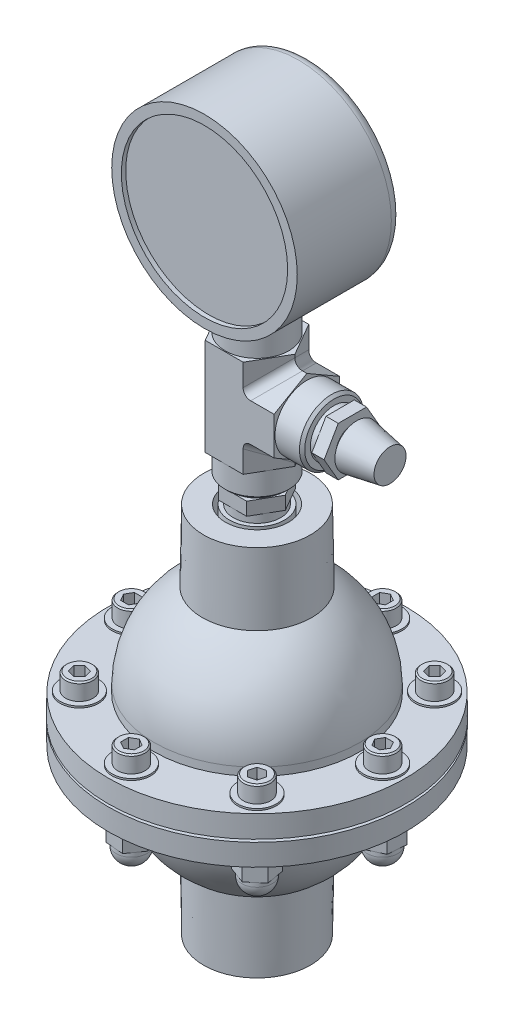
from build123d import *

# Parameters (mm, degrees)
SKETCH1_R                    = 43.2435
EXTRUDE1_DEPTH               = 6.35
EXTRUDE1_TAPER               = 1
SKETCH2_R                    = 29.972
EXTRUDE2_DEPTH               = 37.338
EXTRUDE2_TAPER               = 1
FILLET1_R                    = 29.21
SKETCH3_R                    = 15.494
EXTRUDE3_DEPTH               = 53.6702
EXTRUDE3_DRAFT               = 1
SKETCH4_R                    = 9.144
SKETCH4_R_2                  = 8.001
EXTRUDE4_DEPTH               = 16.637
EXTRUDE4_DRAFT               = -1
SKETCH7_R                    = 43.2435
EXTRUDE5_DEPTH               = 6.35
EXTRUDE5_DRAFT               = -1
SKETCH8_R                    = 32.4866
EXTRUDE6_DEPTH               = 6.35
SKETCH9_R                    = 29.972
EXTRUDE7_DEPTH               = 37.338
EXTRUDE7_DRAFT               = -1
FILLET2_R                    = 29.21
SKETCH11_R                   = 15.494
EXTRUDE8_DEPTH               = 60.833
EXTRUDE8_DRAFT               = -1
SKETCH14_R                   = 5.5626
EXTRUDE9_DEPTH               = 0.508
EXTRUDE10_START              = -0.508
SKETCH15_R                   = 5.5626
EXTRUDE10_DEPTH              = 0.508
SKETCH16_R                   = 3.9624
EXTRUDE11_DEPTH              = 5.334
EXTRUDE12_DEPTH              = 3.175
CHAMFER1_SIZE                = 0.381
EXTRUDE13_DEPTH              = 5.334
SKETCH19_R                   = 4.445
EXTRUDE14_DEPTH              = 10.922
FILLET3_R                    = 4.318
CIRPATTERN1_COUNT            = 8
CHAMFER1_OF_CIRPATTERN1_SIZE = 0.381
FILLET3_OF_CIRPATTERN1_R     = 4.318
SKETCH20_R                   = 6.858
BOSS_EXTRUDE1_DEPTH          = 132.334
SKETCH21_R                   = 26.924
BOSS_EXTRUDE2_DEPTH          = 15.24
BOSS_EXTRUDE3_DEPTH          = 3.81
SKETCH24_R                   = 9.271
BOSS_EXTRUDE4_DEPTH          = 43.18
BOSS_EXTRUDE5_DEPTH          = 28.194
SKETCH26_R                   = 9.271
BOSS_EXTRUDE6_DEPTH          = 22.098
BOSS_EXTRUDE7_DEPTH          = 14.224
SKETCH28_R                   = 6.858
BOSS_EXTRUDE8_DEPTH          = 14.224
BOSS_EXTRUDE9_DEPTH          = 3.556
SKETCH30_R                   = 4.7625
BOSS_EXTRUDE10_DEPTH         = 3.556
SKETCH31_R                   = 6.35
BOSS_EXTRUDE11_DEPTH         = 9.652
BOSS_EXTRUDE11_TAPER         = 10
FILLET4_R                    = 2.54
CHAMFER2_SIZE                = 0.762
FILLET5_R                    = 3.175
SKETCH32_R                   = 24.13
CUT_EXTRUDE1_DEPTH           = 1.27


with BuildPart() as part:
    # Sketch1 → Extrude1 (new body)
    with BuildSketch(Plane(origin=(0, 0, 0), x_dir=(1, 0, 0), z_dir=(0, 1, 0))):
        Circle(SKETCH1_R)
    extrude(amount=EXTRUDE1_DEPTH, taper=EXTRUDE1_TAPER)

    # Sketch2 → Extrude2 (add)
    with BuildSketch(Plane(origin=(0, 0, 0), x_dir=(1, 0, 0), z_dir=(0, 1, 0))):
        Circle(SKETCH2_R)
    extrude(amount=EXTRUDE2_DEPTH, taper=EXTRUDE2_TAPER)

    # Fillet1
    fillet1_edges = [part.edges().sort_by_distance(p)[0] for p in [
        (-29.320262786, 37.338, 0),
    ]]
    fillet(fillet1_edges, radius=FILLET1_R)


with BuildPart() as extrude3_tool:
    # Sketch3 → Extrude3 (with draft: the straight prism first)
    with BuildSketch(Plane(origin=(0, 53.6702, 0), x_dir=(-1, 0, 0), z_dir=(0, 1, 0))):
        Circle(SKETCH3_R)
    extrude(amount=-EXTRUDE3_DEPTH)
    # Extrude3: the draft: its side faces are tilted about the plane it starts from
    extrude3_sides = [extrude3_tool.faces().sort_by_distance(p)[0] for p in [
        (15.494, 26.8351, 0),
    ]]
    draft(extrude3_sides, Plane(origin=(0, 53.6702, 0), x_dir=(-1, 0, 0), z_dir=(0, 1, 0)), EXTRUDE3_DRAFT)


with BuildPart() as part_1:
    add(part.part)

    # Extrude3: add extrude3_tool
    add(extrude3_tool.part)


with BuildPart() as extrude4_tool:
    # Sketch4 → Extrude4 (with draft: the straight prism first)
    with BuildSketch(Plane(origin=(0, 53.6702, 0), x_dir=(-1, 0, 0), z_dir=(0, 1, 0))):
        Circle(SKETCH4_R)
        Circle(SKETCH4_R_2, mode=Mode.SUBTRACT)
    extrude(amount=-EXTRUDE4_DEPTH)
    # Extrude4: the draft: its side faces are tilted about the plane it starts from
    extrude4_sides = [extrude4_tool.faces().sort_by_distance(p)[0] for p in [
        (9.144, 45.3517, 0),
        (8.001, 45.3517, 0),
    ]]
    draft(extrude4_sides, Plane(origin=(0, 53.6702, 0), x_dir=(-1, 0, 0), z_dir=(0, 1, 0)), EXTRUDE4_DRAFT)


with BuildPart() as part_2:
    add(part_1.part)

    # Extrude4: cut by extrude4_tool
    add(extrude4_tool.part, mode=Mode.SUBTRACT)

    # Sketch5 → 1_4 NPT Tapped Hole1 (revolve, cut)
    with BuildSketch(Plane(origin=(0, 53.6702, 0), x_dir=(0, 0, 1), z_dir=(1, 0, 0))):
        Polygon((0, 0), (0, 20.360347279), (5.5626, 17.018), (5.5626, 9.906), (6.557984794, 9.906), (6.8545837, 0), align=None)
    revolve(axis=Axis((0, 60.0202, 0), (0, -1, 0)), mode=Mode.SUBTRACT)



with BuildPart() as body_2:
    # Sketch7 → Extrude5 (with draft: the straight prism first)
    with BuildSketch(Plane(origin=(0, -0.762, 0), x_dir=(-1, 0, 0), z_dir=(0, 1, 0))):
        Circle(SKETCH7_R)
    extrude(amount=-EXTRUDE5_DEPTH)
    # Extrude5: the draft: its side faces are tilted about the plane it starts from
    extrude5_sides = [body_2.faces().sort_by_distance(p)[0] for p in [
        (43.2435, -3.937, 0),
    ]]
    draft(extrude5_sides, Plane(origin=(0, -0.762, 0), x_dir=(-1, 0, 0), z_dir=(0, 1, 0)), EXTRUDE5_DRAFT)


with BuildPart() as part_3:
    add(part_2.part)

    add(body_2.part)  # Extrude6 merges body 2
    # Sketch8 → Extrude6 (add)
    with BuildSketch(Plane(origin=(0, -0.762, 0), x_dir=(-1, 0, 0), z_dir=(0, 1, 0))):
        with Locations(Location((0, 0, 0), (0, 0, 90))):
            Circle(SKETCH8_R)
    extrude(amount=EXTRUDE6_DEPTH)


with BuildPart() as extrude7_tool:
    # Sketch9 → Extrude7 (with draft: the straight prism first)
    with BuildSketch(Plane(origin=(0, -0.762, 0), x_dir=(-1, 0, 0), z_dir=(0, 1, 0))):
        Circle(SKETCH9_R)
    extrude(amount=-EXTRUDE7_DEPTH)
    # Extrude7: the draft: its side faces are tilted about the plane it starts from
    extrude7_sides = [extrude7_tool.faces().sort_by_distance(p)[0] for p in [
        (29.972, -19.431, 0),
    ]]
    draft(extrude7_sides, Plane(origin=(0, -0.762, 0), x_dir=(-1, 0, 0), z_dir=(0, 1, 0)), EXTRUDE7_DRAFT)


with BuildPart() as part_4:
    add(part_3.part)

    # Extrude7: add extrude7_tool
    add(extrude7_tool.part)

    # Fillet2
    fillet2_edges = [part_4.edges().sort_by_distance(p)[0] for p in [
        (29.320262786, -38.1, 0),
    ]]
    fillet(fillet2_edges, radius=FILLET2_R)


with BuildPart() as extrude8_tool:
    # Sketch11 → Extrude8 (with draft: the straight prism first)
    with BuildSketch(Plane(origin=(0, -54.483, 0), x_dir=(-1, 0, 0), z_dir=(0, 1, 0))):
        Circle(SKETCH11_R)
    extrude(amount=EXTRUDE8_DEPTH)
    # Extrude8: the draft: its side faces are tilted about the plane it starts from
    extrude8_sides = [extrude8_tool.faces().sort_by_distance(p)[0] for p in [
        (15.494, -24.0665, 0),
    ]]
    draft(extrude8_sides, Plane(origin=(0, -54.483, 0), x_dir=(-1, 0, 0), z_dir=(0, 1, 0)), EXTRUDE8_DRAFT)


with BuildPart() as part_5:
    add(part_4.part)

    # Extrude8: add extrude8_tool
    add(extrude8_tool.part)

    # Sketch12 → 1_2 NPT Tapped Hole1 (revolve, cut)
    with BuildSketch(Plane(origin=(0, -54.483, 0), x_dir=(0, 0, -1), z_dir=(1, 0, 0))):
        Polygon((0, 0), (0, 27.970543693), (8.9281, 22.606), (8.9281, 13.462), (10.261665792, 13.462), (10.6647361, 0), align=None)
    revolve(axis=Axis((0, -60.833, 0), (0, 1, 0)), mode=Mode.SUBTRACT)

    # Sketch14 → Extrude9 (add)
    with BuildSketch(Plane(origin=(0, 6.35, 0), x_dir=(-1, 0, 0), z_dir=(0, 1, 0))):
        with Locations(Location((-36.449, 0, 0), (0, 0, 90))):
            Circle(SKETCH14_R)
    extrude9 = extrude(amount=EXTRUDE9_DEPTH)

    # Sketch15 → Extrude10 (add)
    with BuildSketch(Plane(origin=(0, -7.112, 0), x_dir=(-1, 0, 0), z_dir=(0, 1, 0)).offset(EXTRUDE10_START)):
        with Locations(Location((-36.449, 0, 0), (0, 0, 90))):
            Circle(SKETCH15_R)
    extrude10 = extrude(amount=EXTRUDE10_DEPTH)

    # Sketch16 → Extrude11 (add)
    with BuildSketch(Plane(origin=(0, 6.35, 0), x_dir=(-1, 0, 0), z_dir=(0, 1, 0))):
        with Locations(Location((-36.449, 0, 0), (0, 0, 90))):
            Circle(SKETCH16_R)
    extrude11 = extrude(amount=EXTRUDE11_DEPTH)

    # Sketch17 → Extrude12 (cut)
    with BuildSketch(Plane(origin=(0, 11.938, 0), x_dir=(-1, 0, 0), z_dir=(0, 1, 0))):
        Polygon((-38.736692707, 0), (-37.592846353, -1.9812), (-35.305153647, -1.9812), (-34.161307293, 0), (-35.305153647, 1.9812), (-37.592846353, 1.9812), align=None)
    extrude12 = extrude(amount=-EXTRUDE12_DEPTH, mode=Mode.SUBTRACT)

    # Chamfer1
    chamfer1_edges = [part_5.edges().sort_by_distance(p)[0] for p in [
        (36.449, 11.684, -3.9624),
    ]]
    chamfer(chamfer1_edges, length=CHAMFER1_SIZE)

    # Sketch18 → Extrude13 (add)
    with BuildSketch(Plane(origin=(0, -7.112, 0), x_dir=(-1, 0, 0), z_dir=(0, 1, 0))):
        Polygon((-40.774215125, 3.027115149), (-41.233166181, -2.232188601), (-36.907951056, -5.259303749), (-32.123784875, -3.027115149), (-31.664833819, 2.232188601), (-35.990048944, 5.259303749), align=None)
    extrude13 = extrude(amount=-EXTRUDE13_DEPTH)

    # Sketch19 → Extrude14 (add)
    with BuildSketch(Plane(origin=(0, -7.112, 0), x_dir=(-1, 0, 0), z_dir=(0, 1, 0))):
        with Locations(Location((-36.449, 0, 0), (0, 0, 90))):
            Circle(SKETCH19_R)
    extrude14 = extrude(amount=-EXTRUDE14_DEPTH)

    # Fillet3
    fillet3_edges = [part_5.edges().sort_by_distance(p)[0] for p in [
        (36.449, -18.034, -4.445),
    ]]
    fillet(fillet3_edges, radius=FILLET3_R)

    # CirPattern1: Extrude9, Extrude10, Extrude11, Extrude12, Extrude13, Extrude14 ×8 about axis
    cirpattern1_axis = Axis((0, 0, 0), (0, 1, 0))
    add([extrude9.rotate(cirpattern1_axis, i * 360 / CIRPATTERN1_COUNT) for i in range(1, CIRPATTERN1_COUNT)])
    add([extrude10.rotate(cirpattern1_axis, i * 360 / CIRPATTERN1_COUNT) for i in range(1, CIRPATTERN1_COUNT)])
    add([extrude11.rotate(cirpattern1_axis, i * 360 / CIRPATTERN1_COUNT) for i in range(1, CIRPATTERN1_COUNT)])
    add([extrude12.rotate(cirpattern1_axis, i * 360 / CIRPATTERN1_COUNT) for i in range(1, CIRPATTERN1_COUNT)], mode=Mode.SUBTRACT)
    add([extrude13.rotate(cirpattern1_axis, i * 360 / CIRPATTERN1_COUNT) for i in range(1, CIRPATTERN1_COUNT)])
    add([extrude14.rotate(cirpattern1_axis, i * 360 / CIRPATTERN1_COUNT) for i in range(1, CIRPATTERN1_COUNT)])

    # Chamfer1 of CirPattern1
    chamfer1_of_cirpattern1_edges = [part_5.edges().sort_by_distance(p)[0] for p in [
        (22.971495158, 11.684, -28.575174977),
        (-3.9624, 11.684, -36.449),
        (-28.575174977, 11.684, -22.971495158),
        (-36.449, 11.684, 3.9624),
        (-22.971495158, 11.684, 28.575174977),
        (3.9624, 11.684, 36.449),
        (28.575174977, 11.684, 22.971495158),
    ]]
    chamfer(chamfer1_of_cirpattern1_edges, length=CHAMFER1_OF_CIRPATTERN1_SIZE)

    # Fillet3 of CirPattern1
    fillet3_of_cirpattern1_edges = [part_5.edges().sort_by_distance(p)[0] for p in [
        (22.630245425, -18.034, -28.91642471),
        (-4.445, -18.034, -36.449),
        (-28.91642471, -18.034, -22.630245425),
        (-36.449, -18.034, 4.445),
        (-22.630245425, -18.034, 28.91642471),
        (4.445, -18.034, 36.449),
        (28.91642471, -18.034, 22.630245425),
    ]]
    fillet(fillet3_of_cirpattern1_edges, radius=FILLET3_OF_CIRPATTERN1_R)

    # Sketch20 → Boss-Extrude1 (add)
    with BuildSketch(Plane(origin=(0, 0, 0), x_dir=(1, 0, 0), z_dir=(0, 1, 0))):
        with Locations(Location((0, 0, 0), (0, 0, 270))):
            Circle(SKETCH20_R)
    extrude(amount=BOSS_EXTRUDE1_DEPTH)

    # Sketch21 → Boss-Extrude2 (add, symmetric)
    with BuildSketch(Plane.XY):
        with Locations((0, 132.334)):
            Circle(SKETCH21_R)
    extrude(amount=BOSS_EXTRUDE2_DEPTH, both=True)

    # Sketch23 → Boss-Extrude3 (add)
    with BuildSketch(Plane(origin=(0, 56.2102, 0), x_dir=(1, 0, 0), z_dir=(0, 1, 0))):
        Polygon((-8.212230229, 0), (-4.106115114, -7.112), (4.106115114, -7.112), (8.212230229, 0), (4.106115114, 7.112), (-4.106115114, 7.112), align=None)
    extrude(amount=BOSS_EXTRUDE3_DEPTH)

    # Sketch24 → Boss-Extrude4 (add)
    with BuildSketch(Plane(origin=(0, 61.2902, 0), x_dir=(1, 0, 0), z_dir=(0, 1, 0))):
        with Locations(Location((0, 0, 0), (0, 0, 270))):
            Circle(SKETCH24_R)
    extrude(amount=BOSS_EXTRUDE4_DEPTH)

    # Sketch25 → Boss-Extrude5 (add)
    with BuildSketch(Plane(origin=(0, 68.6562, 0), x_dir=(1, 0, 0), z_dir=(0, 1, 0))):
        Polygon((-10.998522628, 0), (-5.499261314, -9.525), (5.499261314, -9.525), (10.998522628, 0), (5.499261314, 9.525), (-5.499261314, 9.525), align=None)
    extrude(amount=BOSS_EXTRUDE5_DEPTH)

    # Sketch26 → Boss-Extrude6 (add)
    with BuildSketch(Plane(origin=(22.352, 0, 0), x_dir=(0, 0, -1), z_dir=(1, 0, 0))):
        with Locations((0, 82.7532)):
            Circle(SKETCH26_R)
    extrude(amount=-BOSS_EXTRUDE6_DEPTH)

    # Sketch27 → Boss-Extrude7 (add)
    with BuildSketch(Plane(origin=(14.478, 0, 0), x_dir=(0, 0, -1), z_dir=(1, 0, 0))):
        Polygon((0, 93.751722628), (-9.525, 88.252461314), (-9.525, 77.253938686), (0, 71.754677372), (9.525, 77.253938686), (9.525, 88.252461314), align=None)
    extrude(amount=-BOSS_EXTRUDE7_DEPTH)

    # Sketch28 → Boss-Extrude8 (add)
    with BuildSketch(Plane(origin=(27.686, 0, 0), x_dir=(0, 0, -1), z_dir=(1, 0, 0))):
        with Locations((0, 82.7532)):
            Circle(SKETCH28_R)
    extrude(amount=-BOSS_EXTRUDE8_DEPTH)

    # Sketch29 → Boss-Extrude9 (add)
    with BuildSketch(Plane(origin=(27.686, 0, 0), x_dir=(0, 0, -1), z_dir=(1, 0, 0))):
        Polygon((-8.212230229, 82.7532), (-4.106115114, 75.6412), (4.106115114, 75.6412), (8.212230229, 82.7532), (4.106115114, 89.8652), (-4.106115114, 89.8652), align=None)
    extrude(amount=-BOSS_EXTRUDE9_DEPTH)

    # Sketch30 → Boss-Extrude10 (add)
    with BuildSketch(Plane(origin=(28.956, 0, 0), x_dir=(0, 0, -1), z_dir=(1, 0, 0))):
        with Locations((0, 82.7532)):
            Circle(SKETCH30_R)
    extrude(amount=-BOSS_EXTRUDE10_DEPTH)

    # Sketch31 → Boss-Extrude11 (add)
    with BuildSketch(Plane(origin=(28.956, 0, 0), x_dir=(0, 0, -1), z_dir=(1, 0, 0))):
        with Locations((0, 82.7532)):
            Circle(SKETCH31_R)
    extrude(amount=BOSS_EXTRUDE11_DEPTH, taper=BOSS_EXTRUDE11_TAPER)

    # Fillet4
    fillet4_edges = [part_5.edges().sort_by_distance(p)[0] for p in [
        (8.248891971, 91.002091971, 4.7625),
        (8.248891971, 74.504308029, 4.7625),
        (8.248891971, 91.002091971, -4.7625),
        (8.248891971, 74.504308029, -4.7625),
    ]]
    fillet(fillet4_edges, radius=FILLET4_R)

    # Chamfer2
    chamfer2_edges = [part_5.edges().sort_by_distance(p)[0] for p in [
        (0, 104.4702, -9.271),
        (0, 61.2902, -9.271),
        (22.352, 82.7532, 9.271),
    ]]
    chamfer(chamfer2_edges, length=CHAMFER2_SIZE)

    # Fillet5
    fillet5_edges = [part_5.edges().sort_by_distance(p)[0] for p in [
        (-26.924, 132.334, -15.24),
    ]]
    fillet(fillet5_edges, radius=FILLET5_R)

    # Sketch32 → Cut-Extrude1 (cut)
    with BuildSketch(Plane.XY.offset(15.24)):
        with Locations((0, 132.334)):
            Circle(SKETCH32_R)
    extrude(amount=-CUT_EXTRUDE1_DEPTH, mode=Mode.SUBTRACT)


solid = part_5.part
